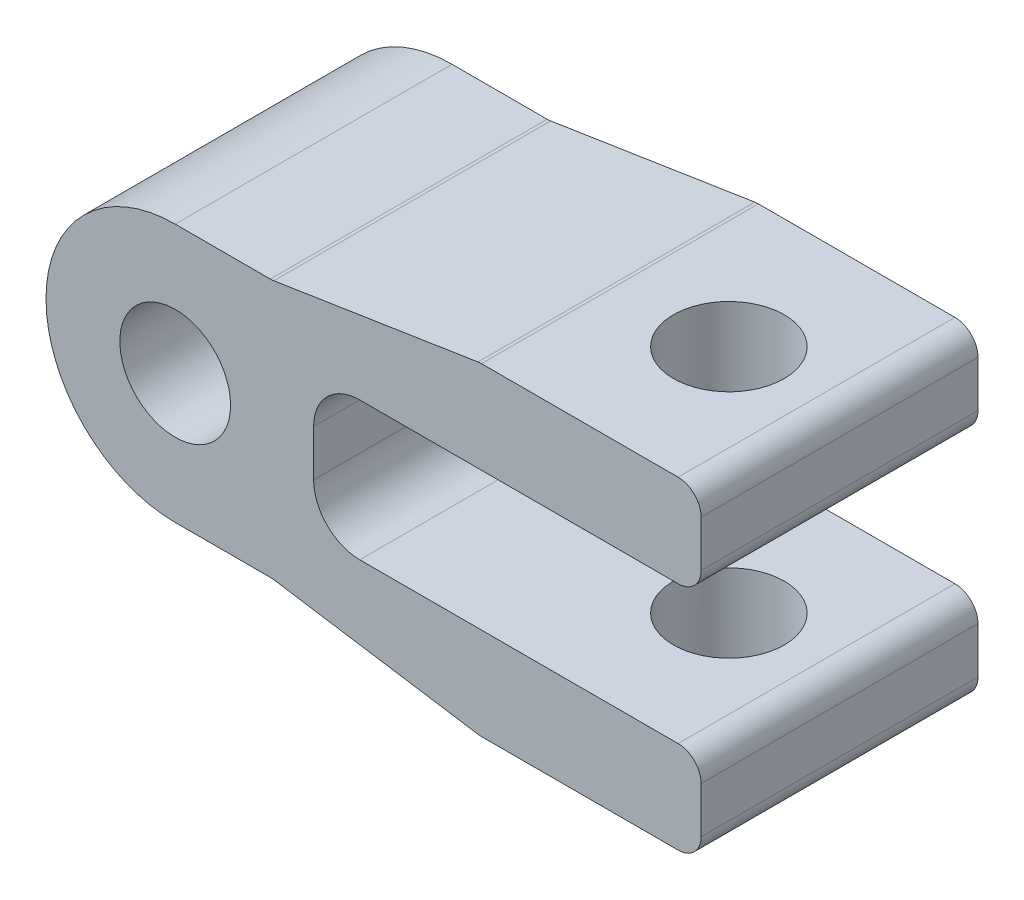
ISO-10303-21;
HEADER;
FILE_DESCRIPTION(('STEP AP214'),'2;1');
FILE_NAME('part.step','',(''),(''),'','','');
FILE_SCHEMA(('AUTOMOTIVE_DESIGN { 1 0 10303 214 1 1 1 1 }'));
ENDSEC;
DATA;
#1=APPLICATION_CONTEXT('core data for automotive mechanical design processes');
#2=APPLICATION_PROTOCOL_DEFINITION('international standard','automotive_design',2000,#1);
#3=PRODUCT_CONTEXT('',#1,'mechanical');
#4=PRODUCT('Part','Part','',(#3));
#5=PRODUCT_RELATED_PRODUCT_CATEGORY('part','',(#4));
#6=PRODUCT_DEFINITION_FORMATION('','',#4);
#7=PRODUCT_DEFINITION_CONTEXT('part definition',#1,'design');
#8=PRODUCT_DEFINITION('design','',#6,#7);
#9=PRODUCT_DEFINITION_SHAPE('','',#8);
#10=(LENGTH_UNIT() NAMED_UNIT(*) SI_UNIT(.MILLI.,.METRE.));
#11=(NAMED_UNIT(*) PLANE_ANGLE_UNIT() SI_UNIT($,.RADIAN.));
#12=(NAMED_UNIT(*) SI_UNIT($,.STERADIAN.) SOLID_ANGLE_UNIT());
#13=UNCERTAINTY_MEASURE_WITH_UNIT(LENGTH_MEASURE(1.E-05),#10,'distance_accuracy_value','');
#14=(GEOMETRIC_REPRESENTATION_CONTEXT(3) GLOBAL_UNCERTAINTY_ASSIGNED_CONTEXT((#13)) GLOBAL_UNIT_ASSIGNED_CONTEXT((#10,
#11,#12)) REPRESENTATION_CONTEXT('',''));
#15=CARTESIAN_POINT('',(0.,0.,0.));
#16=DIRECTION('',(0.,0.,1.));
#17=DIRECTION('',(1.,0.,0.));
#18=AXIS2_PLACEMENT_3D('',#15,#16,#17);
#19=CARTESIAN_POINT('',(0.,0.,30.));
#20=DIRECTION('',(0.,0.,1.));
#21=DIRECTION('',(1.,0.,0.));
#22=AXIS2_PLACEMENT_3D('',#19,#20,#21);
#23=PLANE('',#22);
#24=CARTESIAN_POINT('',(0.,0.,30.));
#25=DIRECTION('',(0.,0.,1.));
#26=DIRECTION('',(1.,0.,0.));
#27=AXIS2_PLACEMENT_3D('',#24,#25,#26);
#28=CIRCLE('',#27,14.);
#29=CARTESIAN_POINT('',(0.,14.,30.));
#30=VERTEX_POINT('',#29);
#31=CARTESIAN_POINT('',(0.,-14.,30.));
#32=VERTEX_POINT('',#31);
#33=EDGE_CURVE('E248',#30,#32,#28,.T.);
#34=ORIENTED_EDGE('',*,*,#33,.T.);
#35=DIRECTION('',(1.,0.,0.));
#36=VECTOR('',#35,1.);
#37=CARTESIAN_POINT('',(0.,-14.,30.));
#38=LINE('',#37,#36);
#39=CARTESIAN_POINT('',(10.3067178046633,-14.,30.));
#40=VERTEX_POINT('',#39);
#41=EDGE_CURVE('E197',#32,#40,#38,.T.);
#42=ORIENTED_EDGE('',*,*,#41,.T.);
#43=CARTESIAN_POINT('',(10.3067178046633,-16.5,30.));
#44=DIRECTION('',(0.,0.,-1.));
#45=DIRECTION('',(1.,0.,0.));
#46=AXIS2_PLACEMENT_3D('',#43,#44,#45);
#47=CIRCLE('',#46,2.5);
#48=CARTESIAN_POINT('',(10.690985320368,-14.0297088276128,30.));
#49=VERTEX_POINT('',#48);
#50=EDGE_CURVE('E251',#40,#49,#47,.T.);
#51=ORIENTED_EDGE('',*,*,#50,.T.);
#52=DIRECTION('',(0.988116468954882,-0.153707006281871,0.));
#53=VECTOR('',#52,1.);
#54=CARTESIAN_POINT('',(10.690985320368,-14.0297088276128,30.));
#55=LINE('',#54,#53);
#56=CARTESIAN_POINT('',(32.8090146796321,-17.4702911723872,30.));
#57=VERTEX_POINT('',#56);
#58=EDGE_CURVE('E253',#49,#57,#55,.T.);
#59=ORIENTED_EDGE('',*,*,#58,.T.);
#60=CARTESIAN_POINT('',(33.1932821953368,-15.,30.));
#61=DIRECTION('',(0.,0.,1.));
#62=DIRECTION('',(1.,0.,0.));
#63=AXIS2_PLACEMENT_3D('',#60,#61,#62);
#64=CIRCLE('',#63,2.5);
#65=CARTESIAN_POINT('',(33.1932821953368,-17.5,30.));
#66=VERTEX_POINT('',#65);
#67=EDGE_CURVE('E255',#57,#66,#64,.T.);
#68=ORIENTED_EDGE('',*,*,#67,.T.);
#69=DIRECTION('',(1.,0.,0.));
#70=VECTOR('',#69,1.);
#71=CARTESIAN_POINT('',(54.5,-17.5,30.));
#72=LINE('',#71,#70);
#73=CARTESIAN_POINT('',(54.5,-17.5,30.));
#74=VERTEX_POINT('',#73);
#75=EDGE_CURVE('E257',#66,#74,#72,.T.);
#76=ORIENTED_EDGE('',*,*,#75,.T.);
#77=CARTESIAN_POINT('',(54.5,-15.,30.));
#78=DIRECTION('',(0.,0.,1.));
#79=DIRECTION('',(1.,0.,0.));
#80=AXIS2_PLACEMENT_3D('',#77,#78,#79);
#81=CIRCLE('',#80,2.5);
#82=CARTESIAN_POINT('',(57.,-15.,30.));
#83=VERTEX_POINT('',#82);
#84=EDGE_CURVE('E259',#74,#83,#81,.T.);
#85=ORIENTED_EDGE('',*,*,#84,.T.);
#86=DIRECTION('',(0.,1.,0.));
#87=VECTOR('',#86,1.);
#88=CARTESIAN_POINT('',(57.,-10.,30.));
#89=LINE('',#88,#87);
#90=CARTESIAN_POINT('',(57.,-10.,30.));
#91=VERTEX_POINT('',#90);
#92=EDGE_CURVE('E261',#83,#91,#89,.T.);
#93=ORIENTED_EDGE('',*,*,#92,.T.);
#94=CARTESIAN_POINT('',(54.5,-10.,30.));
#95=DIRECTION('',(0.,0.,1.));
#96=DIRECTION('',(1.,0.,0.));
#97=AXIS2_PLACEMENT_3D('',#94,#95,#96);
#98=CIRCLE('',#97,2.5);
#99=CARTESIAN_POINT('',(54.5,-7.5,30.));
#100=VERTEX_POINT('',#99);
#101=EDGE_CURVE('E263',#91,#100,#98,.T.);
#102=ORIENTED_EDGE('',*,*,#101,.T.);
#103=DIRECTION('',(-1.,0.,0.));
#104=VECTOR('',#103,1.);
#105=CARTESIAN_POINT('',(20.,-7.5,30.));
#106=LINE('',#105,#104);
#107=CARTESIAN_POINT('',(20.,-7.5,30.));
#108=VERTEX_POINT('',#107);
#109=EDGE_CURVE('E265',#100,#108,#106,.T.);
#110=ORIENTED_EDGE('',*,*,#109,.T.);
#111=CARTESIAN_POINT('',(20.,-2.5,30.));
#112=DIRECTION('',(0.,0.,-1.));
#113=DIRECTION('',(-1.,0.,0.));
#114=AXIS2_PLACEMENT_3D('',#111,#112,#113);
#115=CIRCLE('',#114,5.);
#116=CARTESIAN_POINT('',(15.,-2.5,30.));
#117=VERTEX_POINT('',#116);
#118=EDGE_CURVE('E267',#108,#117,#115,.T.);
#119=ORIENTED_EDGE('',*,*,#118,.T.);
#120=DIRECTION('',(0.,1.,0.));
#121=VECTOR('',#120,1.);
#122=CARTESIAN_POINT('',(15.,2.5,30.));
#123=LINE('',#122,#121);
#124=CARTESIAN_POINT('',(15.,2.5,30.));
#125=VERTEX_POINT('',#124);
#126=EDGE_CURVE('E269',#117,#125,#123,.T.);
#127=ORIENTED_EDGE('',*,*,#126,.T.);
#128=CARTESIAN_POINT('',(20.,2.5,30.));
#129=DIRECTION('',(0.,0.,-1.));
#130=DIRECTION('',(1.,0.,0.));
#131=AXIS2_PLACEMENT_3D('',#128,#129,#130);
#132=CIRCLE('',#131,5.);
#133=CARTESIAN_POINT('',(20.,7.5,30.));
#134=VERTEX_POINT('',#133);
#135=EDGE_CURVE('E271',#125,#134,#132,.T.);
#136=ORIENTED_EDGE('',*,*,#135,.T.);
#137=DIRECTION('',(1.,0.,0.));
#138=VECTOR('',#137,1.);
#139=CARTESIAN_POINT('',(20.,7.5,30.));
#140=LINE('',#139,#138);
#141=CARTESIAN_POINT('',(54.5,7.5,30.));
#142=VERTEX_POINT('',#141);
#143=EDGE_CURVE('E273',#134,#142,#140,.T.);
#144=ORIENTED_EDGE('',*,*,#143,.T.);
#145=CARTESIAN_POINT('',(54.5,10.,30.));
#146=DIRECTION('',(0.,0.,1.));
#147=DIRECTION('',(-1.,0.,0.));
#148=AXIS2_PLACEMENT_3D('',#145,#146,#147);
#149=CIRCLE('',#148,2.5);
#150=CARTESIAN_POINT('',(57.,10.,30.));
#151=VERTEX_POINT('',#150);
#152=EDGE_CURVE('E275',#142,#151,#149,.T.);
#153=ORIENTED_EDGE('',*,*,#152,.T.);
#154=DIRECTION('',(0.,1.,0.));
#155=VECTOR('',#154,1.);
#156=CARTESIAN_POINT('',(57.,10.,30.));
#157=LINE('',#156,#155);
#158=CARTESIAN_POINT('',(57.,15.,30.));
#159=VERTEX_POINT('',#158);
#160=EDGE_CURVE('E277',#151,#159,#157,.T.);
#161=ORIENTED_EDGE('',*,*,#160,.T.);
#162=CARTESIAN_POINT('',(54.5,15.,30.));
#163=DIRECTION('',(0.,0.,1.));
#164=DIRECTION('',(-1.,0.,0.));
#165=AXIS2_PLACEMENT_3D('',#162,#163,#164);
#166=CIRCLE('',#165,2.5);
#167=CARTESIAN_POINT('',(54.5,17.5,30.));
#168=VERTEX_POINT('',#167);
#169=EDGE_CURVE('E279',#159,#168,#166,.T.);
#170=ORIENTED_EDGE('',*,*,#169,.T.);
#171=DIRECTION('',(-1.,0.,0.));
#172=VECTOR('',#171,1.);
#173=CARTESIAN_POINT('',(54.5,17.5,30.));
#174=LINE('',#173,#172);
#175=CARTESIAN_POINT('',(33.1932821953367,17.5,30.));
#176=VERTEX_POINT('',#175);
#177=EDGE_CURVE('E281',#168,#176,#174,.T.);
#178=ORIENTED_EDGE('',*,*,#177,.T.);
#179=CARTESIAN_POINT('',(33.1932821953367,15.,30.));
#180=DIRECTION('',(0.,0.,1.));
#181=DIRECTION('',(-1.,0.,0.));
#182=AXIS2_PLACEMENT_3D('',#179,#180,#181);
#183=CIRCLE('',#182,2.5);
#184=CARTESIAN_POINT('',(32.809014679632,17.4702911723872,30.));
#185=VERTEX_POINT('',#184);
#186=EDGE_CURVE('E283',#176,#185,#183,.T.);
#187=ORIENTED_EDGE('',*,*,#186,.T.);
#188=DIRECTION('',(-0.988116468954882,-0.153707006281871,0.));
#189=VECTOR('',#188,1.);
#190=CARTESIAN_POINT('',(32.809014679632,17.4702911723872,30.));
#191=LINE('',#190,#189);
#192=CARTESIAN_POINT('',(10.690985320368,14.0297088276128,30.));
#193=VERTEX_POINT('',#192);
#194=EDGE_CURVE('E285',#185,#193,#191,.T.);
#195=ORIENTED_EDGE('',*,*,#194,.T.);
#196=CARTESIAN_POINT('',(10.3067178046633,16.5,30.));
#197=DIRECTION('',(0.,0.,-1.));
#198=DIRECTION('',(-1.,0.,0.));
#199=AXIS2_PLACEMENT_3D('',#196,#197,#198);
#200=CIRCLE('',#199,2.5);
#201=CARTESIAN_POINT('',(10.3067178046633,14.,30.));
#202=VERTEX_POINT('',#201);
#203=EDGE_CURVE('E54',#193,#202,#200,.T.);
#204=ORIENTED_EDGE('',*,*,#203,.T.);
#205=DIRECTION('',(-1.,0.,0.));
#206=VECTOR('',#205,1.);
#207=CARTESIAN_POINT('',(0.,14.,30.));
#208=LINE('',#207,#206);
#209=EDGE_CURVE('E49',#202,#30,#208,.T.);
#210=ORIENTED_EDGE('',*,*,#209,.T.);
#211=EDGE_LOOP('',(#34,#42,#51,#59,#68,#76,#85,#93,#102,#110,#119,#127,#136,#144,#153,#161,#170,
#178,#187,#195,#204,#210));
#212=FACE_BOUND('',#211,.T.);
#213=CARTESIAN_POINT('',(0.,0.,30.));
#214=DIRECTION('',(0.,0.,1.));
#215=DIRECTION('',(1.,0.,0.));
#216=AXIS2_PLACEMENT_3D('',#213,#214,#215);
#217=CIRCLE('',#216,6.);
#218=CARTESIAN_POINT('',(6.,0.,30.));
#219=VERTEX_POINT('',#218);
#220=EDGE_CURVE('E202',#219,#219,#217,.T.);
#221=ORIENTED_EDGE('',*,*,#220,.F.);
#222=EDGE_LOOP('',(#221));
#223=FACE_BOUND('',#222,.T.);
#224=ADVANCED_FACE('F34',(#212,#223),#23,.T.);
#225=CARTESIAN_POINT('',(0.,0.,0.));
#226=DIRECTION('',(0.,0.,1.));
#227=DIRECTION('',(1.,0.,0.));
#228=AXIS2_PLACEMENT_3D('',#225,#226,#227);
#229=PLANE('',#228);
#230=CARTESIAN_POINT('',(0.,0.,0.));
#231=DIRECTION('',(0.,0.,1.));
#232=DIRECTION('',(1.,0.,0.));
#233=AXIS2_PLACEMENT_3D('',#230,#231,#232);
#234=CIRCLE('',#233,14.);
#235=CARTESIAN_POINT('',(0.,14.,0.));
#236=VERTEX_POINT('',#235);
#237=CARTESIAN_POINT('',(0.,-14.,0.));
#238=VERTEX_POINT('',#237);
#239=EDGE_CURVE('E188',#236,#238,#234,.T.);
#240=ORIENTED_EDGE('',*,*,#239,.F.);
#241=DIRECTION('',(-1.,0.,0.));
#242=VECTOR('',#241,1.);
#243=CARTESIAN_POINT('',(0.,14.,0.));
#244=LINE('',#243,#242);
#245=CARTESIAN_POINT('',(10.3067178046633,14.,0.));
#246=VERTEX_POINT('',#245);
#247=EDGE_CURVE('E246',#246,#236,#244,.T.);
#248=ORIENTED_EDGE('',*,*,#247,.F.);
#249=CARTESIAN_POINT('',(10.3067178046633,16.5,0.));
#250=DIRECTION('',(0.,0.,-1.));
#251=DIRECTION('',(-1.,0.,0.));
#252=AXIS2_PLACEMENT_3D('',#249,#250,#251);
#253=CIRCLE('',#252,2.5);
#254=CARTESIAN_POINT('',(10.690985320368,14.0297088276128,0.));
#255=VERTEX_POINT('',#254);
#256=EDGE_CURVE('E244',#255,#246,#253,.T.);
#257=ORIENTED_EDGE('',*,*,#256,.F.);
#258=DIRECTION('',(-0.988116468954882,-0.153707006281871,0.));
#259=VECTOR('',#258,1.);
#260=CARTESIAN_POINT('',(32.809014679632,17.4702911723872,0.));
#261=LINE('',#260,#259);
#262=CARTESIAN_POINT('',(32.809014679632,17.4702911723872,0.));
#263=VERTEX_POINT('',#262);
#264=EDGE_CURVE('E242',#263,#255,#261,.T.);
#265=ORIENTED_EDGE('',*,*,#264,.F.);
#266=CARTESIAN_POINT('',(33.1932821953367,15.,0.));
#267=DIRECTION('',(0.,0.,1.));
#268=DIRECTION('',(-1.,0.,0.));
#269=AXIS2_PLACEMENT_3D('',#266,#267,#268);
#270=CIRCLE('',#269,2.5);
#271=CARTESIAN_POINT('',(33.1932821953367,17.5,0.));
#272=VERTEX_POINT('',#271);
#273=EDGE_CURVE('E240',#272,#263,#270,.T.);
#274=ORIENTED_EDGE('',*,*,#273,.F.);
#275=DIRECTION('',(-1.,0.,0.));
#276=VECTOR('',#275,1.);
#277=CARTESIAN_POINT('',(54.5,17.5,0.));
#278=LINE('',#277,#276);
#279=CARTESIAN_POINT('',(54.5,17.5,0.));
#280=VERTEX_POINT('',#279);
#281=EDGE_CURVE('E238',#280,#272,#278,.T.);
#282=ORIENTED_EDGE('',*,*,#281,.F.);
#283=CARTESIAN_POINT('',(54.5,15.,0.));
#284=DIRECTION('',(0.,0.,1.));
#285=DIRECTION('',(-1.,0.,0.));
#286=AXIS2_PLACEMENT_3D('',#283,#284,#285);
#287=CIRCLE('',#286,2.5);
#288=CARTESIAN_POINT('',(57.,15.,0.));
#289=VERTEX_POINT('',#288);
#290=EDGE_CURVE('E236',#289,#280,#287,.T.);
#291=ORIENTED_EDGE('',*,*,#290,.F.);
#292=DIRECTION('',(0.,1.,0.));
#293=VECTOR('',#292,1.);
#294=CARTESIAN_POINT('',(57.,10.,0.));
#295=LINE('',#294,#293);
#296=CARTESIAN_POINT('',(57.,10.,0.));
#297=VERTEX_POINT('',#296);
#298=EDGE_CURVE('E234',#297,#289,#295,.T.);
#299=ORIENTED_EDGE('',*,*,#298,.F.);
#300=CARTESIAN_POINT('',(54.5,10.,0.));
#301=DIRECTION('',(0.,0.,1.));
#302=DIRECTION('',(-1.,0.,0.));
#303=AXIS2_PLACEMENT_3D('',#300,#301,#302);
#304=CIRCLE('',#303,2.5);
#305=CARTESIAN_POINT('',(54.5,7.5,0.));
#306=VERTEX_POINT('',#305);
#307=EDGE_CURVE('E232',#306,#297,#304,.T.);
#308=ORIENTED_EDGE('',*,*,#307,.F.);
#309=DIRECTION('',(1.,0.,0.));
#310=VECTOR('',#309,1.);
#311=CARTESIAN_POINT('',(20.,7.5,0.));
#312=LINE('',#311,#310);
#313=CARTESIAN_POINT('',(20.,7.5,0.));
#314=VERTEX_POINT('',#313);
#315=EDGE_CURVE('E230',#314,#306,#312,.T.);
#316=ORIENTED_EDGE('',*,*,#315,.F.);
#317=CARTESIAN_POINT('',(20.,2.5,0.));
#318=DIRECTION('',(0.,0.,-1.));
#319=DIRECTION('',(1.,0.,0.));
#320=AXIS2_PLACEMENT_3D('',#317,#318,#319);
#321=CIRCLE('',#320,5.);
#322=CARTESIAN_POINT('',(15.,2.5,0.));
#323=VERTEX_POINT('',#322);
#324=EDGE_CURVE('E228',#323,#314,#321,.T.);
#325=ORIENTED_EDGE('',*,*,#324,.F.);
#326=DIRECTION('',(0.,1.,0.));
#327=VECTOR('',#326,1.);
#328=CARTESIAN_POINT('',(15.,2.5,0.));
#329=LINE('',#328,#327);
#330=CARTESIAN_POINT('',(15.,-2.5,0.));
#331=VERTEX_POINT('',#330);
#332=EDGE_CURVE('E226',#331,#323,#329,.T.);
#333=ORIENTED_EDGE('',*,*,#332,.F.);
#334=CARTESIAN_POINT('',(20.,-2.5,0.));
#335=DIRECTION('',(0.,0.,-1.));
#336=DIRECTION('',(-1.,0.,0.));
#337=AXIS2_PLACEMENT_3D('',#334,#335,#336);
#338=CIRCLE('',#337,5.);
#339=CARTESIAN_POINT('',(20.,-7.5,0.));
#340=VERTEX_POINT('',#339);
#341=EDGE_CURVE('E224',#340,#331,#338,.T.);
#342=ORIENTED_EDGE('',*,*,#341,.F.);
#343=DIRECTION('',(-1.,0.,0.));
#344=VECTOR('',#343,1.);
#345=CARTESIAN_POINT('',(20.,-7.5,0.));
#346=LINE('',#345,#344);
#347=CARTESIAN_POINT('',(54.5,-7.5,0.));
#348=VERTEX_POINT('',#347);
#349=EDGE_CURVE('E222',#348,#340,#346,.T.);
#350=ORIENTED_EDGE('',*,*,#349,.F.);
#351=CARTESIAN_POINT('',(54.5,-10.,0.));
#352=DIRECTION('',(0.,0.,1.));
#353=DIRECTION('',(1.,0.,0.));
#354=AXIS2_PLACEMENT_3D('',#351,#352,#353);
#355=CIRCLE('',#354,2.5);
#356=CARTESIAN_POINT('',(57.,-10.,0.));
#357=VERTEX_POINT('',#356);
#358=EDGE_CURVE('E220',#357,#348,#355,.T.);
#359=ORIENTED_EDGE('',*,*,#358,.F.);
#360=DIRECTION('',(0.,1.,0.));
#361=VECTOR('',#360,1.);
#362=CARTESIAN_POINT('',(57.,-10.,0.));
#363=LINE('',#362,#361);
#364=CARTESIAN_POINT('',(57.,-15.,0.));
#365=VERTEX_POINT('',#364);
#366=EDGE_CURVE('E218',#365,#357,#363,.T.);
#367=ORIENTED_EDGE('',*,*,#366,.F.);
#368=CARTESIAN_POINT('',(54.5,-15.,0.));
#369=DIRECTION('',(0.,0.,1.));
#370=DIRECTION('',(1.,0.,0.));
#371=AXIS2_PLACEMENT_3D('',#368,#369,#370);
#372=CIRCLE('',#371,2.5);
#373=CARTESIAN_POINT('',(54.5,-17.5,0.));
#374=VERTEX_POINT('',#373);
#375=EDGE_CURVE('E216',#374,#365,#372,.T.);
#376=ORIENTED_EDGE('',*,*,#375,.F.);
#377=DIRECTION('',(1.,0.,0.));
#378=VECTOR('',#377,1.);
#379=CARTESIAN_POINT('',(54.5,-17.5,0.));
#380=LINE('',#379,#378);
#381=CARTESIAN_POINT('',(33.1932821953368,-17.5,0.));
#382=VERTEX_POINT('',#381);
#383=EDGE_CURVE('E214',#382,#374,#380,.T.);
#384=ORIENTED_EDGE('',*,*,#383,.F.);
#385=CARTESIAN_POINT('',(33.1932821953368,-15.,0.));
#386=DIRECTION('',(0.,0.,1.));
#387=DIRECTION('',(1.,0.,0.));
#388=AXIS2_PLACEMENT_3D('',#385,#386,#387);
#389=CIRCLE('',#388,2.5);
#390=CARTESIAN_POINT('',(32.8090146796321,-17.4702911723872,0.));
#391=VERTEX_POINT('',#390);
#392=EDGE_CURVE('E212',#391,#382,#389,.T.);
#393=ORIENTED_EDGE('',*,*,#392,.F.);
#394=DIRECTION('',(0.988116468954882,-0.153707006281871,0.));
#395=VECTOR('',#394,1.);
#396=CARTESIAN_POINT('',(10.690985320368,-14.0297088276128,0.));
#397=LINE('',#396,#395);
#398=CARTESIAN_POINT('',(10.690985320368,-14.0297088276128,0.));
#399=VERTEX_POINT('',#398);
#400=EDGE_CURVE('E210',#399,#391,#397,.T.);
#401=ORIENTED_EDGE('',*,*,#400,.F.);
#402=CARTESIAN_POINT('',(10.3067178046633,-16.5,0.));
#403=DIRECTION('',(0.,0.,-1.));
#404=DIRECTION('',(1.,0.,0.));
#405=AXIS2_PLACEMENT_3D('',#402,#403,#404);
#406=CIRCLE('',#405,2.5);
#407=CARTESIAN_POINT('',(10.3067178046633,-14.,0.));
#408=VERTEX_POINT('',#407);
#409=EDGE_CURVE('E190',#408,#399,#406,.T.);
#410=ORIENTED_EDGE('',*,*,#409,.F.);
#411=DIRECTION('',(1.,0.,0.));
#412=VECTOR('',#411,1.);
#413=CARTESIAN_POINT('',(0.,-14.,0.));
#414=LINE('',#413,#412);
#415=EDGE_CURVE('E183',#238,#408,#414,.T.);
#416=ORIENTED_EDGE('',*,*,#415,.F.);
#417=EDGE_LOOP('',(#240,#248,#257,#265,#274,#282,#291,#299,#308,#316,#325,#333,#342,#350,#359,
#367,#376,#384,#393,#401,#410,#416));
#418=FACE_BOUND('',#417,.T.);
#419=CARTESIAN_POINT('',(0.,0.,0.));
#420=DIRECTION('',(0.,0.,1.));
#421=DIRECTION('',(1.,0.,0.));
#422=AXIS2_PLACEMENT_3D('',#419,#420,#421);
#423=CIRCLE('',#422,6.);
#424=CARTESIAN_POINT('',(6.,0.,0.));
#425=VERTEX_POINT('',#424);
#426=EDGE_CURVE('E205',#425,#425,#423,.T.);
#427=ORIENTED_EDGE('',*,*,#426,.T.);
#428=EDGE_LOOP('',(#427));
#429=FACE_BOUND('',#428,.T.);
#430=ADVANCED_FACE('F184',(#418,#429),#229,.F.);
#431=CARTESIAN_POINT('',(0.,0.,30.));
#432=DIRECTION('',(0.,0.,-1.));
#433=DIRECTION('',(-1.,0.,0.));
#434=AXIS2_PLACEMENT_3D('',#431,#432,#433);
#435=CYLINDRICAL_SURFACE('',#434,14.);
#436=ORIENTED_EDGE('',*,*,#239,.T.);
#437=DIRECTION('',(0.,0.,-1.));
#438=VECTOR('',#437,1.);
#439=CARTESIAN_POINT('',(0.,-14.,30.));
#440=LINE('',#439,#438);
#441=EDGE_CURVE('E11',#32,#238,#440,.T.);
#442=ORIENTED_EDGE('',*,*,#441,.F.);
#443=ORIENTED_EDGE('',*,*,#33,.F.);
#444=DIRECTION('',(0.,0.,-1.));
#445=VECTOR('',#444,1.);
#446=CARTESIAN_POINT('',(0.,14.,30.));
#447=LINE('',#446,#445);
#448=EDGE_CURVE('E201',#30,#236,#447,.T.);
#449=ORIENTED_EDGE('',*,*,#448,.T.);
#450=EDGE_LOOP('',(#436,#442,#443,#449));
#451=FACE_BOUND('',#450,.T.);
#452=ADVANCED_FACE('F36',(#451),#435,.T.);
#453=CARTESIAN_POINT('',(0.,-14.,30.));
#454=DIRECTION('',(0.,1.,0.));
#455=DIRECTION('',(-1.,0.,0.));
#456=AXIS2_PLACEMENT_3D('',#453,#454,#455);
#457=PLANE('',#456);
#458=ORIENTED_EDGE('',*,*,#415,.T.);
#459=DIRECTION('',(0.,0.,-1.));
#460=VECTOR('',#459,1.);
#461=CARTESIAN_POINT('',(10.3067178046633,-14.,30.));
#462=LINE('',#461,#460);
#463=EDGE_CURVE('E42',#40,#408,#462,.T.);
#464=ORIENTED_EDGE('',*,*,#463,.F.);
#465=ORIENTED_EDGE('',*,*,#41,.F.);
#466=ORIENTED_EDGE('',*,*,#441,.T.);
#467=EDGE_LOOP('',(#458,#464,#465,#466));
#468=FACE_BOUND('',#467,.T.);
#469=ADVANCED_FACE('F196',(#468),#457,.F.);
#470=CARTESIAN_POINT('',(10.3067178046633,-16.5,30.));
#471=DIRECTION('',(0.,0.,-1.));
#472=DIRECTION('',(-1.,0.,0.));
#473=AXIS2_PLACEMENT_3D('',#470,#471,#472);
#474=CYLINDRICAL_SURFACE('',#473,2.5);
#475=ORIENTED_EDGE('',*,*,#409,.T.);
#476=DIRECTION('',(0.,0.,-1.));
#477=VECTOR('',#476,1.);
#478=CARTESIAN_POINT('',(10.690985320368,-14.0297088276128,30.));
#479=LINE('',#478,#477);
#480=EDGE_CURVE('E344',#49,#399,#479,.T.);
#481=ORIENTED_EDGE('',*,*,#480,.F.);
#482=ORIENTED_EDGE('',*,*,#50,.F.);
#483=ORIENTED_EDGE('',*,*,#463,.T.);
#484=EDGE_LOOP('',(#475,#481,#482,#483));
#485=FACE_BOUND('',#484,.T.);
#486=ADVANCED_FACE('F348',(#485),#474,.F.);
#487=CARTESIAN_POINT('',(10.690985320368,-14.0297088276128,30.));
#488=DIRECTION('',(0.153707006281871,0.988116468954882,0.));
#489=DIRECTION('',(-0.988116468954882,0.153707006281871,0.));
#490=AXIS2_PLACEMENT_3D('',#487,#488,#489);
#491=PLANE('',#490);
#492=ORIENTED_EDGE('',*,*,#400,.T.);
#493=DIRECTION('',(0.,0.,-1.));
#494=VECTOR('',#493,1.);
#495=CARTESIAN_POINT('',(32.8090146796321,-17.4702911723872,30.));
#496=LINE('',#495,#494);
#497=EDGE_CURVE('E341',#57,#391,#496,.T.);
#498=ORIENTED_EDGE('',*,*,#497,.F.);
#499=ORIENTED_EDGE('',*,*,#58,.F.);
#500=ORIENTED_EDGE('',*,*,#480,.T.);
#501=EDGE_LOOP('',(#492,#498,#499,#500));
#502=FACE_BOUND('',#501,.T.);
#503=ADVANCED_FACE('F356',(#502),#491,.F.);
#504=CARTESIAN_POINT('',(33.1932821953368,-15.,30.));
#505=DIRECTION('',(0.,0.,-1.));
#506=DIRECTION('',(-1.,0.,0.));
#507=AXIS2_PLACEMENT_3D('',#504,#505,#506);
#508=CYLINDRICAL_SURFACE('',#507,2.5);
#509=ORIENTED_EDGE('',*,*,#392,.T.);
#510=DIRECTION('',(0.,0.,-1.));
#511=VECTOR('',#510,1.);
#512=CARTESIAN_POINT('',(33.1932821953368,-17.5,30.));
#513=LINE('',#512,#511);
#514=EDGE_CURVE('E338',#66,#382,#513,.T.);
#515=ORIENTED_EDGE('',*,*,#514,.F.);
#516=ORIENTED_EDGE('',*,*,#67,.F.);
#517=ORIENTED_EDGE('',*,*,#497,.T.);
#518=EDGE_LOOP('',(#509,#515,#516,#517));
#519=FACE_BOUND('',#518,.T.);
#520=ADVANCED_FACE('F359',(#519),#508,.T.);
#521=CARTESIAN_POINT('',(54.5,-17.5,30.));
#522=DIRECTION('',(0.,1.,0.));
#523=DIRECTION('',(0.,0.,1.));
#524=AXIS2_PLACEMENT_3D('',#521,#522,#523);
#525=PLANE('',#524);
#526=CARTESIAN_POINT('',(45.,-17.5,15.));
#527=DIRECTION('',(0.,-1.,0.));
#528=DIRECTION('',(1.,0.,0.));
#529=AXIS2_PLACEMENT_3D('',#526,#527,#528);
#530=CIRCLE('',#529,6.);
#531=CARTESIAN_POINT('',(51.,-17.5,15.));
#532=VERTEX_POINT('',#531);
#533=EDGE_CURVE('E468',#532,#532,#530,.T.);
#534=ORIENTED_EDGE('',*,*,#533,.F.);
#535=EDGE_LOOP('',(#534));
#536=FACE_BOUND('',#535,.T.);
#537=ORIENTED_EDGE('',*,*,#383,.T.);
#538=DIRECTION('',(0.,0.,-1.));
#539=VECTOR('',#538,1.);
#540=CARTESIAN_POINT('',(54.5,-17.5,30.));
#541=LINE('',#540,#539);
#542=EDGE_CURVE('E335',#74,#374,#541,.T.);
#543=ORIENTED_EDGE('',*,*,#542,.F.);
#544=ORIENTED_EDGE('',*,*,#75,.F.);
#545=ORIENTED_EDGE('',*,*,#514,.T.);
#546=EDGE_LOOP('',(#537,#543,#544,#545));
#547=FACE_BOUND('',#546,.T.);
#548=ADVANCED_FACE('F364',(#536,#547),#525,.F.);
#549=CARTESIAN_POINT('',(54.5,-15.,30.));
#550=DIRECTION('',(0.,0.,-1.));
#551=DIRECTION('',(-1.,0.,0.));
#552=AXIS2_PLACEMENT_3D('',#549,#550,#551);
#553=CYLINDRICAL_SURFACE('',#552,2.5);
#554=ORIENTED_EDGE('',*,*,#375,.T.);
#555=DIRECTION('',(0.,0.,-1.));
#556=VECTOR('',#555,1.);
#557=CARTESIAN_POINT('',(57.,-15.,30.));
#558=LINE('',#557,#556);
#559=EDGE_CURVE('E332',#83,#365,#558,.T.);
#560=ORIENTED_EDGE('',*,*,#559,.F.);
#561=ORIENTED_EDGE('',*,*,#84,.F.);
#562=ORIENTED_EDGE('',*,*,#542,.T.);
#563=EDGE_LOOP('',(#554,#560,#561,#562));
#564=FACE_BOUND('',#563,.T.);
#565=ADVANCED_FACE('F370',(#564),#553,.T.);
#566=CARTESIAN_POINT('',(57.,-10.,30.));
#567=DIRECTION('',(-1.,0.,0.));
#568=DIRECTION('',(0.,-1.,0.));
#569=AXIS2_PLACEMENT_3D('',#566,#567,#568);
#570=PLANE('',#569);
#571=ORIENTED_EDGE('',*,*,#366,.T.);
#572=DIRECTION('',(0.,0.,-1.));
#573=VECTOR('',#572,1.);
#574=CARTESIAN_POINT('',(57.,-10.,30.));
#575=LINE('',#574,#573);
#576=EDGE_CURVE('E329',#91,#357,#575,.T.);
#577=ORIENTED_EDGE('',*,*,#576,.F.);
#578=ORIENTED_EDGE('',*,*,#92,.F.);
#579=ORIENTED_EDGE('',*,*,#559,.T.);
#580=EDGE_LOOP('',(#571,#577,#578,#579));
#581=FACE_BOUND('',#580,.T.);
#582=ADVANCED_FACE('F374',(#581),#570,.F.);
#583=CARTESIAN_POINT('',(54.5,-10.,30.));
#584=DIRECTION('',(0.,0.,-1.));
#585=DIRECTION('',(-1.,0.,0.));
#586=AXIS2_PLACEMENT_3D('',#583,#584,#585);
#587=CYLINDRICAL_SURFACE('',#586,2.5);
#588=ORIENTED_EDGE('',*,*,#358,.T.);
#589=DIRECTION('',(0.,0.,-1.));
#590=VECTOR('',#589,1.);
#591=CARTESIAN_POINT('',(54.5,-7.5,30.));
#592=LINE('',#591,#590);
#593=EDGE_CURVE('E326',#100,#348,#592,.T.);
#594=ORIENTED_EDGE('',*,*,#593,.F.);
#595=ORIENTED_EDGE('',*,*,#101,.F.);
#596=ORIENTED_EDGE('',*,*,#576,.T.);
#597=EDGE_LOOP('',(#588,#594,#595,#596));
#598=FACE_BOUND('',#597,.T.);
#599=ADVANCED_FACE('F379',(#598),#587,.T.);
#600=CARTESIAN_POINT('',(20.,-7.5,30.));
#601=DIRECTION('',(0.,-1.,0.));
#602=DIRECTION('',(0.,0.,-1.));
#603=AXIS2_PLACEMENT_3D('',#600,#601,#602);
#604=PLANE('',#603);
#605=CARTESIAN_POINT('',(45.,-7.5,15.));
#606=DIRECTION('',(0.,-1.,0.));
#607=DIRECTION('',(0.,0.,-1.));
#608=AXIS2_PLACEMENT_3D('',#605,#606,#607);
#609=CIRCLE('',#608,6.);
#610=CARTESIAN_POINT('',(45.,-7.5,9.));
#611=VERTEX_POINT('',#610);
#612=EDGE_CURVE('E471',#611,#611,#609,.T.);
#613=ORIENTED_EDGE('',*,*,#612,.T.);
#614=EDGE_LOOP('',(#613));
#615=FACE_BOUND('',#614,.T.);
#616=ORIENTED_EDGE('',*,*,#349,.T.);
#617=DIRECTION('',(0.,0.,-1.));
#618=VECTOR('',#617,1.);
#619=CARTESIAN_POINT('',(20.,-7.5,30.));
#620=LINE('',#619,#618);
#621=EDGE_CURVE('E323',#108,#340,#620,.T.);
#622=ORIENTED_EDGE('',*,*,#621,.F.);
#623=ORIENTED_EDGE('',*,*,#109,.F.);
#624=ORIENTED_EDGE('',*,*,#593,.T.);
#625=EDGE_LOOP('',(#616,#622,#623,#624));
#626=FACE_BOUND('',#625,.T.);
#627=ADVANCED_FACE('F385',(#615,#626),#604,.F.);
#628=CARTESIAN_POINT('',(20.,-2.5,30.));
#629=DIRECTION('',(0.,0.,-1.));
#630=DIRECTION('',(-1.,0.,0.));
#631=AXIS2_PLACEMENT_3D('',#628,#629,#630);
#632=CYLINDRICAL_SURFACE('',#631,5.);
#633=ORIENTED_EDGE('',*,*,#341,.T.);
#634=DIRECTION('',(0.,0.,-1.));
#635=VECTOR('',#634,1.);
#636=CARTESIAN_POINT('',(15.,-2.5,30.));
#637=LINE('',#636,#635);
#638=EDGE_CURVE('E320',#117,#331,#637,.T.);
#639=ORIENTED_EDGE('',*,*,#638,.F.);
#640=ORIENTED_EDGE('',*,*,#118,.F.);
#641=ORIENTED_EDGE('',*,*,#621,.T.);
#642=EDGE_LOOP('',(#633,#639,#640,#641));
#643=FACE_BOUND('',#642,.T.);
#644=ADVANCED_FACE('F389',(#643),#632,.F.);
#645=CARTESIAN_POINT('',(15.,2.5,30.));
#646=DIRECTION('',(-1.,0.,0.));
#647=DIRECTION('',(0.,0.,1.));
#648=AXIS2_PLACEMENT_3D('',#645,#646,#647);
#649=PLANE('',#648);
#650=ORIENTED_EDGE('',*,*,#332,.T.);
#651=DIRECTION('',(0.,0.,-1.));
#652=VECTOR('',#651,1.);
#653=CARTESIAN_POINT('',(15.,2.5,30.));
#654=LINE('',#653,#652);
#655=EDGE_CURVE('E317',#125,#323,#654,.T.);
#656=ORIENTED_EDGE('',*,*,#655,.F.);
#657=ORIENTED_EDGE('',*,*,#126,.F.);
#658=ORIENTED_EDGE('',*,*,#638,.T.);
#659=EDGE_LOOP('',(#650,#656,#657,#658));
#660=FACE_BOUND('',#659,.T.);
#661=ADVANCED_FACE('F394',(#660),#649,.F.);
#662=CARTESIAN_POINT('',(20.,2.5,30.));
#663=DIRECTION('',(0.,0.,-1.));
#664=DIRECTION('',(-1.,0.,0.));
#665=AXIS2_PLACEMENT_3D('',#662,#663,#664);
#666=CYLINDRICAL_SURFACE('',#665,5.);
#667=ORIENTED_EDGE('',*,*,#324,.T.);
#668=DIRECTION('',(0.,0.,-1.));
#669=VECTOR('',#668,1.);
#670=CARTESIAN_POINT('',(20.,7.5,30.));
#671=LINE('',#670,#669);
#672=EDGE_CURVE('E314',#134,#314,#671,.T.);
#673=ORIENTED_EDGE('',*,*,#672,.F.);
#674=ORIENTED_EDGE('',*,*,#135,.F.);
#675=ORIENTED_EDGE('',*,*,#655,.T.);
#676=EDGE_LOOP('',(#667,#673,#674,#675));
#677=FACE_BOUND('',#676,.T.);
#678=ADVANCED_FACE('F400',(#677),#666,.F.);
#679=CARTESIAN_POINT('',(20.,7.5,30.));
#680=DIRECTION('',(0.,1.,0.));
#681=DIRECTION('',(0.,0.,1.));
#682=AXIS2_PLACEMENT_3D('',#679,#680,#681);
#683=PLANE('',#682);
#684=CARTESIAN_POINT('',(45.,7.5,15.));
#685=DIRECTION('',(0.,1.,0.));
#686=DIRECTION('',(0.,0.,1.));
#687=AXIS2_PLACEMENT_3D('',#684,#685,#686);
#688=CIRCLE('',#687,6.);
#689=CARTESIAN_POINT('',(45.,7.5,21.));
#690=VERTEX_POINT('',#689);
#691=EDGE_CURVE('E473',#690,#690,#688,.T.);
#692=ORIENTED_EDGE('',*,*,#691,.T.);
#693=EDGE_LOOP('',(#692));
#694=FACE_BOUND('',#693,.T.);
#695=ORIENTED_EDGE('',*,*,#315,.T.);
#696=DIRECTION('',(0.,0.,-1.));
#697=VECTOR('',#696,1.);
#698=CARTESIAN_POINT('',(54.5,7.5,30.));
#699=LINE('',#698,#697);
#700=EDGE_CURVE('E311',#142,#306,#699,.T.);
#701=ORIENTED_EDGE('',*,*,#700,.F.);
#702=ORIENTED_EDGE('',*,*,#143,.F.);
#703=ORIENTED_EDGE('',*,*,#672,.T.);
#704=EDGE_LOOP('',(#695,#701,#702,#703));
#705=FACE_BOUND('',#704,.T.);
#706=ADVANCED_FACE('F404',(#694,#705),#683,.F.);
#707=CARTESIAN_POINT('',(54.5,10.,30.));
#708=DIRECTION('',(0.,0.,-1.));
#709=DIRECTION('',(-1.,0.,0.));
#710=AXIS2_PLACEMENT_3D('',#707,#708,#709);
#711=CYLINDRICAL_SURFACE('',#710,2.5);
#712=ORIENTED_EDGE('',*,*,#307,.T.);
#713=DIRECTION('',(0.,0.,-1.));
#714=VECTOR('',#713,1.);
#715=CARTESIAN_POINT('',(57.,10.,30.));
#716=LINE('',#715,#714);
#717=EDGE_CURVE('E308',#151,#297,#716,.T.);
#718=ORIENTED_EDGE('',*,*,#717,.F.);
#719=ORIENTED_EDGE('',*,*,#152,.F.);
#720=ORIENTED_EDGE('',*,*,#700,.T.);
#721=EDGE_LOOP('',(#712,#718,#719,#720));
#722=FACE_BOUND('',#721,.T.);
#723=ADVANCED_FACE('F409',(#722),#711,.T.);
#724=CARTESIAN_POINT('',(57.,10.,30.));
#725=DIRECTION('',(-1.,0.,0.));
#726=DIRECTION('',(0.,0.,1.));
#727=AXIS2_PLACEMENT_3D('',#724,#725,#726);
#728=PLANE('',#727);
#729=ORIENTED_EDGE('',*,*,#298,.T.);
#730=DIRECTION('',(0.,0.,-1.));
#731=VECTOR('',#730,1.);
#732=CARTESIAN_POINT('',(57.,15.,30.));
#733=LINE('',#732,#731);
#734=EDGE_CURVE('E305',#159,#289,#733,.T.);
#735=ORIENTED_EDGE('',*,*,#734,.F.);
#736=ORIENTED_EDGE('',*,*,#160,.F.);
#737=ORIENTED_EDGE('',*,*,#717,.T.);
#738=EDGE_LOOP('',(#729,#735,#736,#737));
#739=FACE_BOUND('',#738,.T.);
#740=ADVANCED_FACE('F415',(#739),#728,.F.);
#741=CARTESIAN_POINT('',(54.5,15.,30.));
#742=DIRECTION('',(0.,0.,-1.));
#743=DIRECTION('',(-1.,0.,0.));
#744=AXIS2_PLACEMENT_3D('',#741,#742,#743);
#745=CYLINDRICAL_SURFACE('',#744,2.5);
#746=ORIENTED_EDGE('',*,*,#290,.T.);
#747=DIRECTION('',(0.,0.,-1.));
#748=VECTOR('',#747,1.);
#749=CARTESIAN_POINT('',(54.5,17.5,30.));
#750=LINE('',#749,#748);
#751=EDGE_CURVE('E302',#168,#280,#750,.T.);
#752=ORIENTED_EDGE('',*,*,#751,.F.);
#753=ORIENTED_EDGE('',*,*,#169,.F.);
#754=ORIENTED_EDGE('',*,*,#734,.T.);
#755=EDGE_LOOP('',(#746,#752,#753,#754));
#756=FACE_BOUND('',#755,.T.);
#757=ADVANCED_FACE('F419',(#756),#745,.T.);
#758=CARTESIAN_POINT('',(54.5,17.5,30.));
#759=DIRECTION('',(0.,-1.,0.));
#760=DIRECTION('',(1.,0.,0.));
#761=AXIS2_PLACEMENT_3D('',#758,#759,#760);
#762=PLANE('',#761);
#763=CARTESIAN_POINT('',(45.,17.5,15.));
#764=DIRECTION('',(0.,-1.,0.));
#765=DIRECTION('',(1.,0.,0.));
#766=AXIS2_PLACEMENT_3D('',#763,#764,#765);
#767=CIRCLE('',#766,6.);
#768=CARTESIAN_POINT('',(51.,17.5,15.));
#769=VERTEX_POINT('',#768);
#770=EDGE_CURVE('E477',#769,#769,#767,.T.);
#771=ORIENTED_EDGE('',*,*,#770,.T.);
#772=EDGE_LOOP('',(#771));
#773=FACE_BOUND('',#772,.T.);
#774=ORIENTED_EDGE('',*,*,#281,.T.);
#775=DIRECTION('',(0.,0.,-1.));
#776=VECTOR('',#775,1.);
#777=CARTESIAN_POINT('',(33.1932821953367,17.5,30.));
#778=LINE('',#777,#776);
#779=EDGE_CURVE('E299',#176,#272,#778,.T.);
#780=ORIENTED_EDGE('',*,*,#779,.F.);
#781=ORIENTED_EDGE('',*,*,#177,.F.);
#782=ORIENTED_EDGE('',*,*,#751,.T.);
#783=EDGE_LOOP('',(#774,#780,#781,#782));
#784=FACE_BOUND('',#783,.T.);
#785=ADVANCED_FACE('F424',(#773,#784),#762,.F.);
#786=CARTESIAN_POINT('',(33.1932821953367,15.,30.));
#787=DIRECTION('',(0.,0.,-1.));
#788=DIRECTION('',(-1.,0.,0.));
#789=AXIS2_PLACEMENT_3D('',#786,#787,#788);
#790=CYLINDRICAL_SURFACE('',#789,2.5);
#791=ORIENTED_EDGE('',*,*,#273,.T.);
#792=DIRECTION('',(0.,0.,-1.));
#793=VECTOR('',#792,1.);
#794=CARTESIAN_POINT('',(32.809014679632,17.4702911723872,30.));
#795=LINE('',#794,#793);
#796=EDGE_CURVE('E296',#185,#263,#795,.T.);
#797=ORIENTED_EDGE('',*,*,#796,.F.);
#798=ORIENTED_EDGE('',*,*,#186,.F.);
#799=ORIENTED_EDGE('',*,*,#779,.T.);
#800=EDGE_LOOP('',(#791,#797,#798,#799));
#801=FACE_BOUND('',#800,.T.);
#802=ADVANCED_FACE('F430',(#801),#790,.T.);
#803=CARTESIAN_POINT('',(32.809014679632,17.4702911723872,30.));
#804=DIRECTION('',(0.153707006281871,-0.988116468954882,0.));
#805=DIRECTION('',(0.988116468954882,0.153707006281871,0.));
#806=AXIS2_PLACEMENT_3D('',#803,#804,#805);
#807=PLANE('',#806);
#808=ORIENTED_EDGE('',*,*,#264,.T.);
#809=DIRECTION('',(0.,0.,-1.));
#810=VECTOR('',#809,1.);
#811=CARTESIAN_POINT('',(10.690985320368,14.0297088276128,30.));
#812=LINE('',#811,#810);
#813=EDGE_CURVE('E293',#193,#255,#812,.T.);
#814=ORIENTED_EDGE('',*,*,#813,.F.);
#815=ORIENTED_EDGE('',*,*,#194,.F.);
#816=ORIENTED_EDGE('',*,*,#796,.T.);
#817=EDGE_LOOP('',(#808,#814,#815,#816));
#818=FACE_BOUND('',#817,.T.);
#819=ADVANCED_FACE('F434',(#818),#807,.F.);
#820=CARTESIAN_POINT('',(10.3067178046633,16.5,30.));
#821=DIRECTION('',(0.,0.,-1.));
#822=DIRECTION('',(-1.,0.,0.));
#823=AXIS2_PLACEMENT_3D('',#820,#821,#822);
#824=CYLINDRICAL_SURFACE('',#823,2.5);
#825=ORIENTED_EDGE('',*,*,#256,.T.);
#826=DIRECTION('',(0.,0.,-1.));
#827=VECTOR('',#826,1.);
#828=CARTESIAN_POINT('',(10.3067178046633,14.,30.));
#829=LINE('',#828,#827);
#830=EDGE_CURVE('E290',#202,#246,#829,.T.);
#831=ORIENTED_EDGE('',*,*,#830,.F.);
#832=ORIENTED_EDGE('',*,*,#203,.F.);
#833=ORIENTED_EDGE('',*,*,#813,.T.);
#834=EDGE_LOOP('',(#825,#831,#832,#833));
#835=FACE_BOUND('',#834,.T.);
#836=ADVANCED_FACE('F437',(#835),#824,.F.);
#837=CARTESIAN_POINT('',(0.,14.,30.));
#838=DIRECTION('',(0.,-1.,0.));
#839=DIRECTION('',(0.,0.,-1.));
#840=AXIS2_PLACEMENT_3D('',#837,#838,#839);
#841=PLANE('',#840);
#842=ORIENTED_EDGE('',*,*,#247,.T.);
#843=ORIENTED_EDGE('',*,*,#448,.F.);
#844=ORIENTED_EDGE('',*,*,#209,.F.);
#845=ORIENTED_EDGE('',*,*,#830,.T.);
#846=EDGE_LOOP('',(#842,#843,#844,#845));
#847=FACE_BOUND('',#846,.T.);
#848=ADVANCED_FACE('F439',(#847),#841,.F.);
#849=CARTESIAN_POINT('',(0.,0.,30.));
#850=DIRECTION('',(0.,0.,-1.));
#851=DIRECTION('',(-1.,0.,0.));
#852=AXIS2_PLACEMENT_3D('',#849,#850,#851);
#853=CYLINDRICAL_SURFACE('',#852,6.);
#854=ORIENTED_EDGE('',*,*,#220,.T.);
#855=EDGE_LOOP('',(#854));
#856=FACE_BOUND('',#855,.T.);
#857=ORIENTED_EDGE('',*,*,#426,.F.);
#858=EDGE_LOOP('',(#857));
#859=FACE_BOUND('',#858,.T.);
#860=ADVANCED_FACE('F441',(#856,#859),#853,.F.);
#861=CARTESIAN_POINT('',(45.,17.5,15.));
#862=DIRECTION('',(0.,-1.,0.));
#863=DIRECTION('',(1.,0.,0.));
#864=AXIS2_PLACEMENT_3D('',#861,#862,#863);
#865=CYLINDRICAL_SURFACE('',#864,6.);
#866=ORIENTED_EDGE('',*,*,#770,.F.);
#867=EDGE_LOOP('',(#866));
#868=FACE_BOUND('',#867,.T.);
#869=ORIENTED_EDGE('',*,*,#691,.F.);
#870=EDGE_LOOP('',(#869));
#871=FACE_BOUND('',#870,.T.);
#872=ADVANCED_FACE('F447',(#868,#871),#865,.F.);
#873=ORIENTED_EDGE('',*,*,#533,.T.);
#874=EDGE_LOOP('',(#873));
#875=FACE_BOUND('',#874,.T.);
#876=ORIENTED_EDGE('',*,*,#612,.F.);
#877=EDGE_LOOP('',(#876));
#878=FACE_BOUND('',#877,.T.);
#879=ADVANCED_FACE('F458',(#875,#878),#865,.F.);
#880=CLOSED_SHELL('',(#224,#430,#452,#469,#486,#503,#520,#548,#565,#582,#599,#627,#644,#661,
#678,#706,#723,#740,#757,#785,#802,#819,#836,#848,#860,#872,#879));
#881=MANIFOLD_SOLID_BREP('B2',#880);
#882=ADVANCED_BREP_SHAPE_REPRESENTATION('',(#18,#881),#14);
#883=SHAPE_DEFINITION_REPRESENTATION(#9,#882);
ENDSEC;
END-ISO-10303-21;
